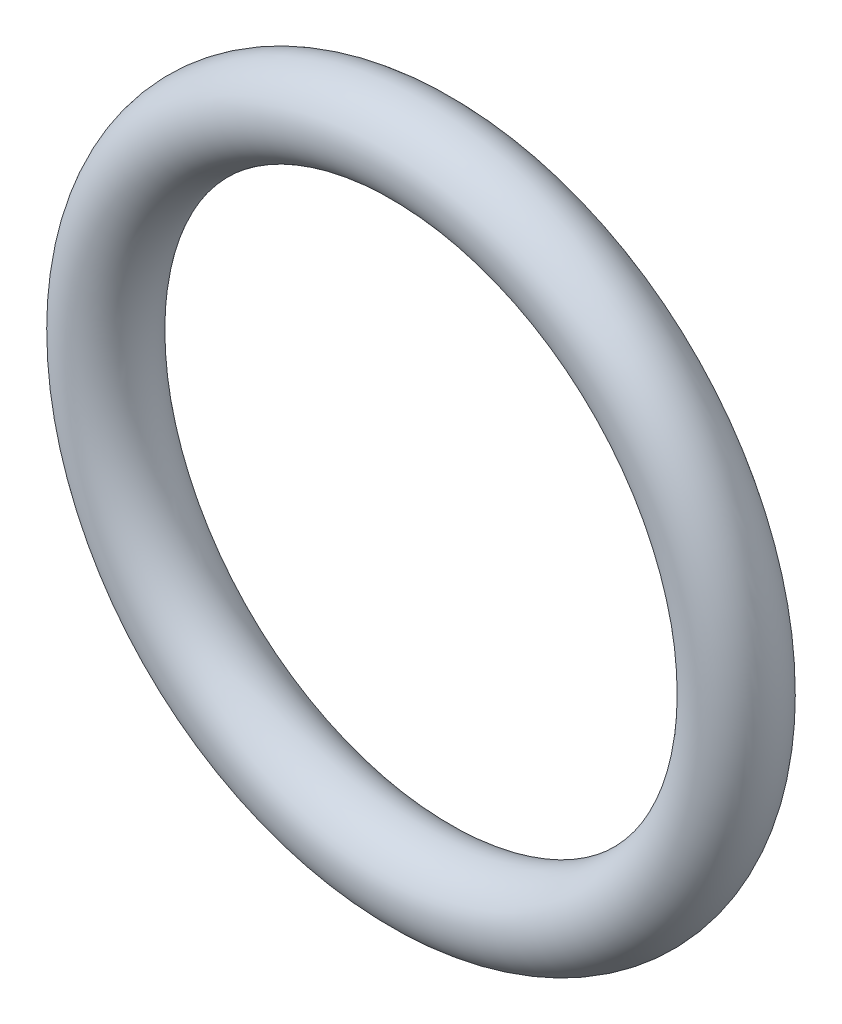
from build123d import *

# Parameters (mm, degrees)
SKETCH1_R = 1.3081


with BuildPart() as part:
    # Sketch1 → Revolve1 (revolve)
    with BuildSketch(Plane(origin=(0, 0, 0), x_dir=(0, -1, 0), z_dir=(1, 0, 0)), mode=Mode.PRIVATE) as revolve1_sk:
        with Locations((9.8679, 0)):
            Circle(SKETCH1_R)
    revolve(revolve1_sk.sketch.rotate(Axis((0, 0, 1.3081), (0, 0, -1)), 270), axis=Axis((0, 0, 1.3081), (0, 0, -1)))


solid = part.part
